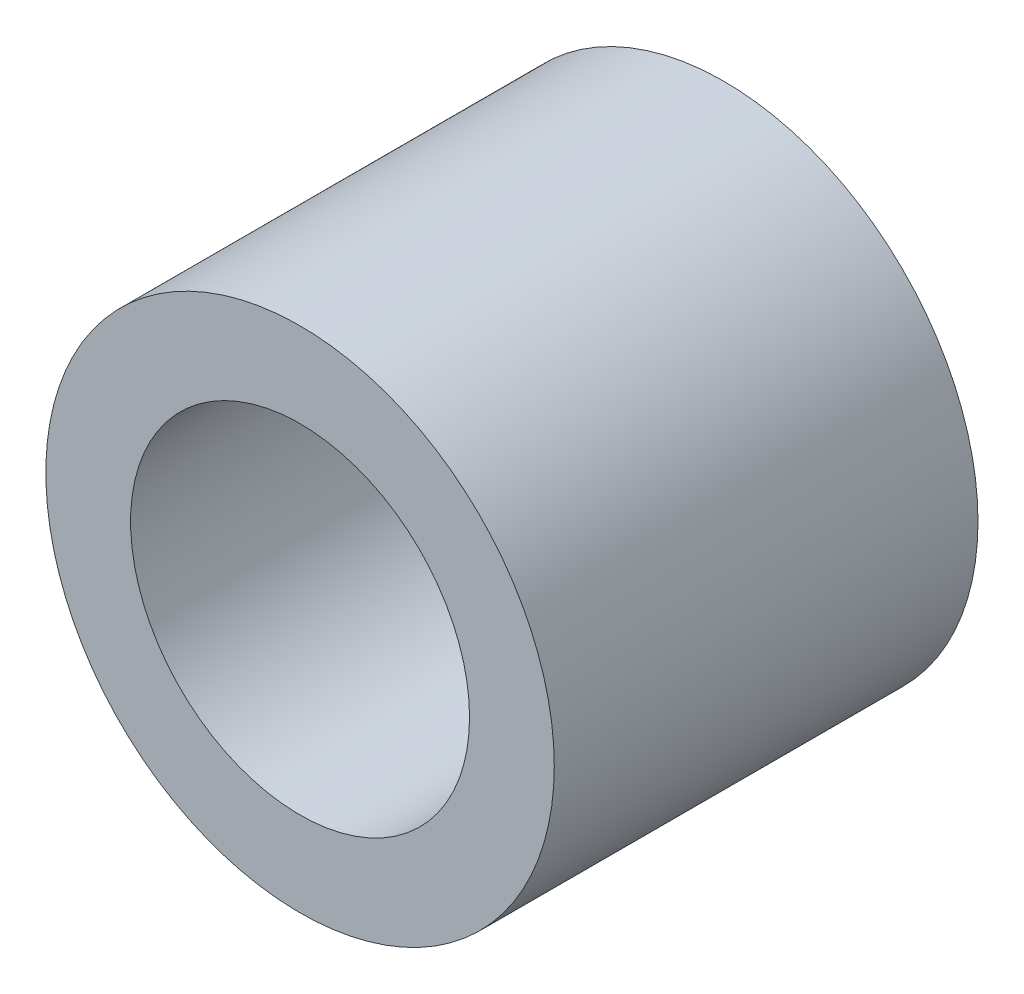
from build123d import *

# Parameters (mm, degrees)
SKIZZE1_R                       = 15
SKIZZE1_R_2                     = 10
AUFSATZ_LINEAR_AUSTRAGEN1_DEPTH = 25


with BuildPart() as part:
    # Skizze1 → Aufsatz-Linear austragen1 (new body)
    with BuildSketch(Plane.XY):
        Circle(SKIZZE1_R)
        Circle(SKIZZE1_R_2, mode=Mode.SUBTRACT)
    extrude(amount=AUFSATZ_LINEAR_AUSTRAGEN1_DEPTH)


solid = part.part
